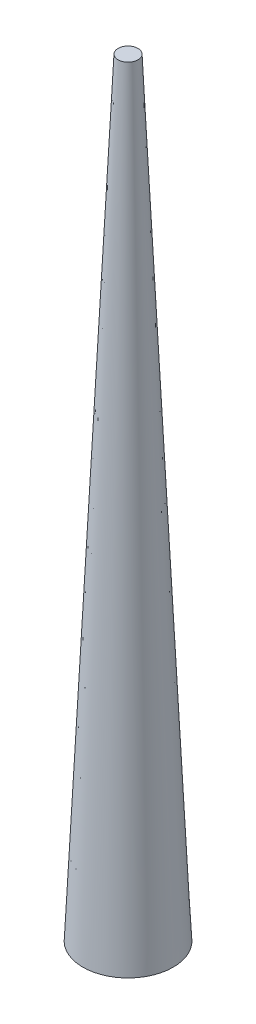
ISO-10303-21;
HEADER;
FILE_DESCRIPTION(('STEP AP214'),'2;1');
FILE_NAME('part.step','',(''),(''),'','','');
FILE_SCHEMA(('AUTOMOTIVE_DESIGN { 1 0 10303 214 1 1 1 1 }'));
ENDSEC;
DATA;
#1=APPLICATION_CONTEXT('core data for automotive mechanical design processes');
#2=APPLICATION_PROTOCOL_DEFINITION('international standard','automotive_design',2000,#1);
#3=PRODUCT_CONTEXT('',#1,'mechanical');
#4=PRODUCT('Part','Part','',(#3));
#5=PRODUCT_RELATED_PRODUCT_CATEGORY('part','',(#4));
#6=PRODUCT_DEFINITION_FORMATION('','',#4);
#7=PRODUCT_DEFINITION_CONTEXT('part definition',#1,'design');
#8=PRODUCT_DEFINITION('design','',#6,#7);
#9=PRODUCT_DEFINITION_SHAPE('','',#8);
#10=(LENGTH_UNIT() NAMED_UNIT(*) SI_UNIT(.MILLI.,.METRE.));
#11=(NAMED_UNIT(*) PLANE_ANGLE_UNIT() SI_UNIT($,.RADIAN.));
#12=(NAMED_UNIT(*) SI_UNIT($,.STERADIAN.) SOLID_ANGLE_UNIT());
#13=UNCERTAINTY_MEASURE_WITH_UNIT(LENGTH_MEASURE(1.E-05),#10,'distance_accuracy_value','');
#14=(GEOMETRIC_REPRESENTATION_CONTEXT(3) GLOBAL_UNCERTAINTY_ASSIGNED_CONTEXT((#13)) GLOBAL_UNIT_ASSIGNED_CONTEXT((#10,
#11,#12)) REPRESENTATION_CONTEXT('',''));
#15=CARTESIAN_POINT('',(0.,0.,0.));
#16=DIRECTION('',(0.,0.,1.));
#17=DIRECTION('',(1.,0.,0.));
#18=AXIS2_PLACEMENT_3D('',#15,#16,#17);
#19=CARTESIAN_POINT('',(0.,90000.,0.));
#20=DIRECTION('',(0.,-1.,0.));
#21=DIRECTION('',(0.,0.,-1.));
#22=AXIS2_PLACEMENT_3D('',#19,#20,#21);
#23=PLANE('',#22);
#24=CARTESIAN_POINT('',(0.,90000.,0.));
#25=DIRECTION('',(0.,-1.,0.));
#26=DIRECTION('',(0.,0.,-1.));
#27=AXIS2_PLACEMENT_3D('',#24,#25,#26);
#28=CIRCLE('',#27,5000.);
#29=CARTESIAN_POINT('',(5000.,90000.,8.97931843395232E-07));
#30=VERTEX_POINT('',#29);
#31=CARTESIAN_POINT('',(5000.,90000.,0.));
#32=VERTEX_POINT('',#31);
#33=EDGE_CURVE('E11',#30,#32,#28,.T.);
#34=ORIENTED_EDGE('',*,*,#33,.T.);
#35=DIRECTION('',(1.,0.,0.));
#36=VECTOR('',#35,1.);
#37=CARTESIAN_POINT('',(0.,90000.,0.));
#38=LINE('',#37,#36);
#39=CARTESIAN_POINT('',(0.,90000.,0.));
#40=VERTEX_POINT('',#39);
#41=EDGE_CURVE('E71',#40,#32,#38,.T.);
#42=ORIENTED_EDGE('',*,*,#41,.F.);
#43=DIRECTION('',(1.,0.,1.79586368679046E-10));
#44=VECTOR('',#43,1.);
#45=CARTESIAN_POINT('',(0.,90000.,0.));
#46=LINE('',#45,#44);
#47=EDGE_CURVE('E73',#40,#30,#46,.T.);
#48=ORIENTED_EDGE('',*,*,#47,.T.);
#49=EDGE_LOOP('',(#34,#42,#48));
#50=FACE_BOUND('',#49,.T.);
#51=ADVANCED_FACE('F39',(#50),#23,.T.);
#52=CARTESIAN_POINT('',(0.,90000.,0.));
#53=DIRECTION('',(0.,-1.,0.));
#54=DIRECTION('',(0.,0.,-1.));
#55=AXIS2_PLACEMENT_3D('',#52,#53,#54);
#56=CONICAL_SURFACE('',#55,5000.,0.0458501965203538);
#57=CARTESIAN_POINT('',(0.,175000.,0.));
#58=DIRECTION('',(0.,-1.,0.));
#59=DIRECTION('',(0.,0.,-1.));
#60=AXIS2_PLACEMENT_3D('',#57,#58,#59);
#61=CIRCLE('',#60,1100.);
#62=CARTESIAN_POINT('',(1100.,175000.,1.97545005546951E-07));
#63=VERTEX_POINT('',#62);
#64=CARTESIAN_POINT('',(1100.,175000.,0.));
#65=VERTEX_POINT('',#64);
#66=EDGE_CURVE('E46',#63,#65,#61,.T.);
#67=ORIENTED_EDGE('',*,*,#66,.T.);
#68=DIRECTION('',(-0.0458341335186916,0.99894906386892,0.));
#69=VECTOR('',#68,1.);
#70=CARTESIAN_POINT('',(5000.,90000.,0.));
#71=LINE('',#70,#69);
#72=EDGE_CURVE('E78',#32,#65,#71,.T.);
#73=ORIENTED_EDGE('',*,*,#72,.F.);
#74=ORIENTED_EDGE('',*,*,#33,.F.);
#75=DIRECTION('',(-0.0458341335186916,0.99894906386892,-8.23118560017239E-12));
#76=VECTOR('',#75,1.);
#77=CARTESIAN_POINT('',(5000.,90000.,8.97931843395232E-07));
#78=LINE('',#77,#76);
#79=EDGE_CURVE('E90',#30,#63,#78,.T.);
#80=ORIENTED_EDGE('',*,*,#79,.T.);
#81=EDGE_LOOP('',(#67,#73,#74,#80));
#82=FACE_BOUND('',#81,.T.);
#83=ADVANCED_FACE('F85',(#82),#56,.T.);
#84=CARTESIAN_POINT('',(1100.,175000.,1.97545005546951E-07));
#85=DIRECTION('',(0.,1.,0.));
#86=DIRECTION('',(0.,0.,1.));
#87=AXIS2_PLACEMENT_3D('',#84,#85,#86);
#88=PLANE('',#87);
#89=DIRECTION('',(-1.,0.,-1.79586368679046E-10));
#90=VECTOR('',#89,1.);
#91=CARTESIAN_POINT('',(1100.,175000.,1.97545005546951E-07));
#92=LINE('',#91,#90);
#93=CARTESIAN_POINT('',(0.,175000.,0.));
#94=VERTEX_POINT('',#93);
#95=EDGE_CURVE('E93',#63,#94,#92,.T.);
#96=ORIENTED_EDGE('',*,*,#95,.T.);
#97=DIRECTION('',(-1.,0.,0.));
#98=VECTOR('',#97,1.);
#99=CARTESIAN_POINT('',(1100.,175000.,0.));
#100=LINE('',#99,#98);
#101=EDGE_CURVE('E52',#65,#94,#100,.T.);
#102=ORIENTED_EDGE('',*,*,#101,.F.);
#103=ORIENTED_EDGE('',*,*,#66,.F.);
#104=EDGE_LOOP('',(#96,#102,#103));
#105=FACE_BOUND('',#104,.T.);
#106=ADVANCED_FACE('F91',(#105),#88,.T.);
#107=CARTESIAN_POINT('',(0.,0.,0.));
#108=DIRECTION('',(-1.79586368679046E-10,0.,1.));
#109=DIRECTION('',(1.,0.,1.79586368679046E-10));
#110=AXIS2_PLACEMENT_3D('',#107,#108,#109);
#111=PLANE('',#110);
#112=DIRECTION('',(0.,-1.,0.));
#113=VECTOR('',#112,1.);
#114=CARTESIAN_POINT('',(0.,175000.,0.));
#115=LINE('',#114,#113);
#116=EDGE_CURVE('E82',#94,#40,#115,.T.);
#117=ORIENTED_EDGE('',*,*,#116,.F.);
#118=ORIENTED_EDGE('',*,*,#95,.F.);
#119=ORIENTED_EDGE('',*,*,#79,.F.);
#120=ORIENTED_EDGE('',*,*,#47,.F.);
#121=EDGE_LOOP('',(#117,#118,#119,#120));
#122=FACE_BOUND('',#121,.T.);
#123=ADVANCED_FACE('F92',(#122),#111,.F.);
#124=CARTESIAN_POINT('',(0.,0.,0.));
#125=DIRECTION('',(0.,0.,1.));
#126=DIRECTION('',(1.,0.,0.));
#127=AXIS2_PLACEMENT_3D('',#124,#125,#126);
#128=PLANE('',#127);
#129=ORIENTED_EDGE('',*,*,#116,.T.);
#130=ORIENTED_EDGE('',*,*,#41,.T.);
#131=ORIENTED_EDGE('',*,*,#72,.T.);
#132=ORIENTED_EDGE('',*,*,#101,.T.);
#133=EDGE_LOOP('',(#129,#130,#131,#132));
#134=FACE_BOUND('',#133,.T.);
#135=ADVANCED_FACE('F76',(#134),#128,.T.);
#136=CLOSED_SHELL('',(#51,#83,#106,#123,#135));
#137=MANIFOLD_SOLID_BREP('B2',#136);
#138=ADVANCED_BREP_SHAPE_REPRESENTATION('',(#18,#137),#14);
#139=SHAPE_DEFINITION_REPRESENTATION(#9,#138);
ENDSEC;
END-ISO-10303-21;
